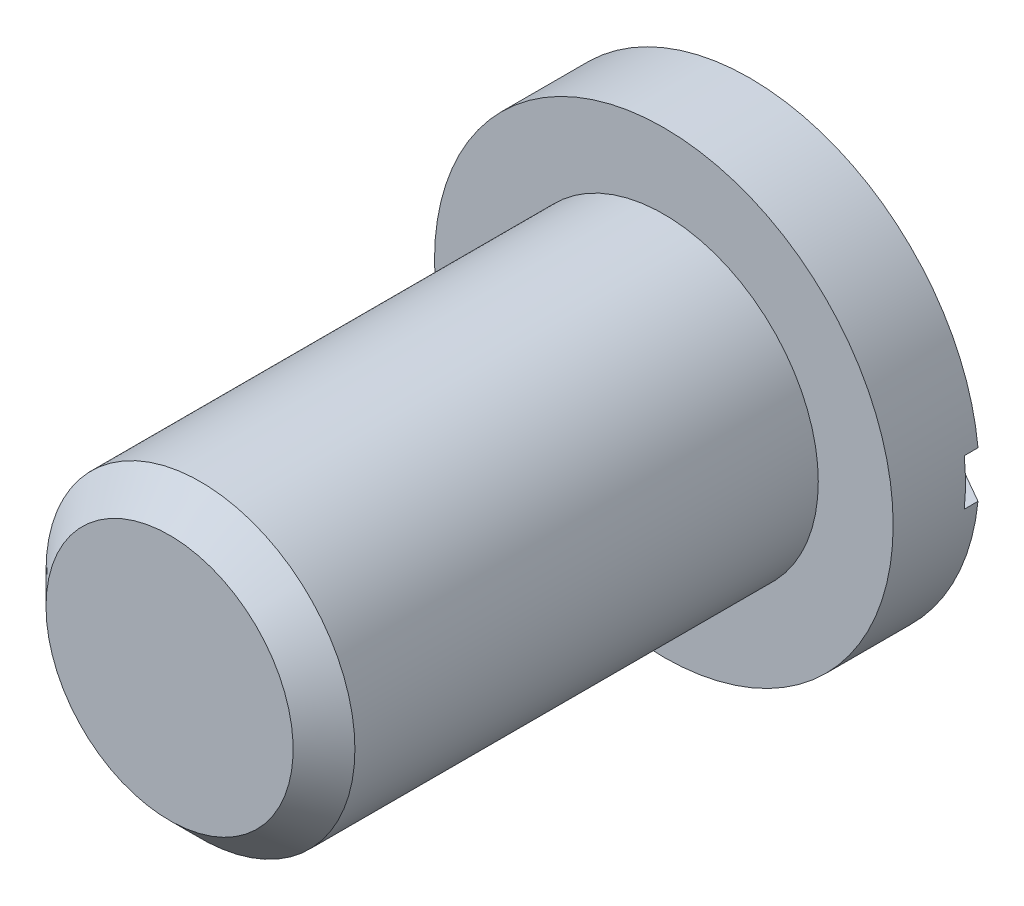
from build123d import *

# Parameters (mm, degrees)
SKETCH_2_W          = 1.190625
SKETCH_2_H          = 1.190625
CUT_EXTRUDE_1_DEPTH = 6.35


with BuildPart() as part:
    # Sketch 1 → Revolve 1 (revolve)
    with BuildSketch(Plane(origin=(0, 0, 0), x_dir=(0, 0, -1), z_dir=(1, 0, 0)), mode=Mode.PRIVATE) as revolve_1_sk:
        Polygon((0, 0), (-15.748, 0), (-15.748, 3.175), (-14.95425, 3.96875), (-3.048, 3.96875), (-3.048, 5.8928), (-0.8382, 5.8928), (0, 4.440995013), align=None)
    revolve(revolve_1_sk.sketch.rotate(Axis((0, 0, 0), (0, 0, 1)), 90), axis=Axis((0, 0, 0), (0, 0, 1)))

    # Sketch 2 → Cut-Extrude 1 (cut, symmetric)
    with BuildSketch(Plane(origin=(0, 0, 0), x_dir=(0, 0, -1), z_dir=(1, 0, 0))):
        with Locations((-0.5953125, 0)):
            Rectangle(SKETCH_2_W, SKETCH_2_H)
    extrude(amount=CUT_EXTRUDE_1_DEPTH, both=True, mode=Mode.SUBTRACT)


solid = part.part
